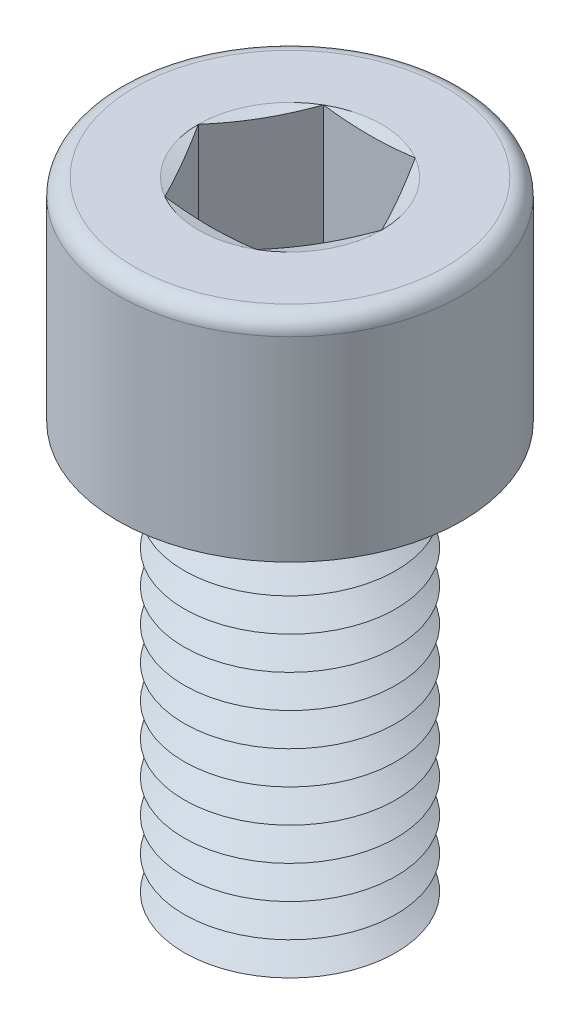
ISO-10303-21;
HEADER;
FILE_DESCRIPTION(('STEP AP214'),'2;1');
FILE_NAME('part.step','',(''),(''),'','','');
FILE_SCHEMA(('AUTOMOTIVE_DESIGN { 1 0 10303 214 1 1 1 1 }'));
ENDSEC;
DATA;
#1=APPLICATION_CONTEXT('core data for automotive mechanical design processes');
#2=APPLICATION_PROTOCOL_DEFINITION('international standard','automotive_design',2000,#1);
#3=PRODUCT_CONTEXT('',#1,'mechanical');
#4=PRODUCT('Part','Part','',(#3));
#5=PRODUCT_RELATED_PRODUCT_CATEGORY('part','',(#4));
#6=PRODUCT_DEFINITION_FORMATION('','',#4);
#7=PRODUCT_DEFINITION_CONTEXT('part definition',#1,'design');
#8=PRODUCT_DEFINITION('design','',#6,#7);
#9=PRODUCT_DEFINITION_SHAPE('','',#8);
#10=(LENGTH_UNIT() NAMED_UNIT(*) SI_UNIT(.MILLI.,.METRE.));
#11=(NAMED_UNIT(*) PLANE_ANGLE_UNIT() SI_UNIT($,.RADIAN.));
#12=(NAMED_UNIT(*) SI_UNIT($,.STERADIAN.) SOLID_ANGLE_UNIT());
#13=UNCERTAINTY_MEASURE_WITH_UNIT(LENGTH_MEASURE(1.E-05),#10,'distance_accuracy_value','');
#14=(GEOMETRIC_REPRESENTATION_CONTEXT(3) GLOBAL_UNCERTAINTY_ASSIGNED_CONTEXT((#13)) GLOBAL_UNIT_ASSIGNED_CONTEXT((#10,
#11,#12)) REPRESENTATION_CONTEXT('',''));
#15=CARTESIAN_POINT('',(0.,0.,0.));
#16=DIRECTION('',(0.,0.,1.));
#17=DIRECTION('',(1.,0.,0.));
#18=AXIS2_PLACEMENT_3D('',#15,#16,#17);
#19=CARTESIAN_POINT('',(0.,5.,0.));
#20=DIRECTION('',(0.,1.,0.));
#21=DIRECTION('',(0.,0.,1.));
#22=AXIS2_PLACEMENT_3D('',#19,#20,#21);
#23=CONICAL_SURFACE('',#22,2.91746824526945,1.0471975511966);
#24=CARTESIAN_POINT('',(0.,5.625,0.));
#25=DIRECTION('',(0.,1.,0.));
#26=DIRECTION('',(0.,0.,1.));
#27=AXIS2_PLACEMENT_3D('',#24,#25,#26);
#28=CIRCLE('',#27,4.);
#29=CARTESIAN_POINT('',(0.,5.625,4.));
#30=VERTEX_POINT('',#29);
#31=EDGE_CURVE('E414',#30,#30,#28,.T.);
#32=ORIENTED_EDGE('',*,*,#31,.F.);
#33=EDGE_LOOP('',(#32));
#34=FACE_BOUND('',#33,.T.);
#35=CARTESIAN_POINT('',(0.,5.,0.));
#36=DIRECTION('',(0.,1.,0.));
#37=DIRECTION('',(0.,0.,1.));
#38=AXIS2_PLACEMENT_3D('',#35,#36,#37);
#39=CIRCLE('',#38,2.91746824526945);
#40=CARTESIAN_POINT('',(0.,5.,2.91746824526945));
#41=VERTEX_POINT('',#40);
#42=EDGE_CURVE('E418',#41,#41,#39,.T.);
#43=ORIENTED_EDGE('',*,*,#42,.T.);
#44=EDGE_LOOP('',(#43));
#45=FACE_BOUND('',#44,.T.);
#46=ADVANCED_FACE('F41',(#34,#45),#23,.T.);
#47=CARTESIAN_POINT('',(0.,4.375,0.));
#48=DIRECTION('',(0.,-1.,0.));
#49=DIRECTION('',(0.,0.,-1.));
#50=AXIS2_PLACEMENT_3D('',#47,#48,#49);
#51=CONICAL_SURFACE('',#50,4.,1.0471975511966);
#52=ORIENTED_EDGE('',*,*,#42,.F.);
#53=EDGE_LOOP('',(#52));
#54=FACE_BOUND('',#53,.T.);
#55=CARTESIAN_POINT('',(0.,4.375,0.));
#56=DIRECTION('',(0.,1.,0.));
#57=DIRECTION('',(0.,0.,1.));
#58=AXIS2_PLACEMENT_3D('',#55,#56,#57);
#59=CIRCLE('',#58,4.);
#60=CARTESIAN_POINT('',(0.,4.375,4.));
#61=VERTEX_POINT('',#60);
#62=EDGE_CURVE('E422',#61,#61,#59,.T.);
#63=ORIENTED_EDGE('',*,*,#62,.T.);
#64=EDGE_LOOP('',(#63));
#65=FACE_BOUND('',#64,.T.);
#66=ADVANCED_FACE('F251',(#54,#65),#51,.T.);
#67=CARTESIAN_POINT('',(0.,0.,0.));
#68=DIRECTION('',(0.,1.,0.));
#69=DIRECTION('',(0.,0.,1.));
#70=AXIS2_PLACEMENT_3D('',#67,#68,#69);
#71=PLANE('',#70);
#72=CARTESIAN_POINT('',(0.,0.,0.));
#73=DIRECTION('',(0.,1.,0.));
#74=DIRECTION('',(0.,0.,1.));
#75=AXIS2_PLACEMENT_3D('',#72,#73,#74);
#76=CIRCLE('',#75,2.91746824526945);
#77=CARTESIAN_POINT('',(0.,0.,2.91746824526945));
#78=VERTEX_POINT('',#77);
#79=EDGE_CURVE('E450',#78,#78,#76,.T.);
#80=ORIENTED_EDGE('',*,*,#79,.F.);
#81=EDGE_LOOP('',(#80));
#82=FACE_BOUND('',#81,.T.);
#83=ADVANCED_FACE('F248',(#82),#71,.F.);
#84=CARTESIAN_POINT('',(0.,0.,0.));
#85=DIRECTION('',(0.,1.,0.));
#86=DIRECTION('',(0.,0.,1.));
#87=AXIS2_PLACEMENT_3D('',#84,#85,#86);
#88=CONICAL_SURFACE('',#87,2.91746824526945,1.0471975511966);
#89=CARTESIAN_POINT('',(0.,0.624999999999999,0.));
#90=DIRECTION('',(0.,1.,0.));
#91=DIRECTION('',(0.,0.,1.));
#92=AXIS2_PLACEMENT_3D('',#89,#90,#91);
#93=CIRCLE('',#92,4.);
#94=CARTESIAN_POINT('',(0.,0.624999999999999,4.));
#95=VERTEX_POINT('',#94);
#96=EDGE_CURVE('E446',#95,#95,#93,.T.);
#97=ORIENTED_EDGE('',*,*,#96,.F.);
#98=EDGE_LOOP('',(#97));
#99=FACE_BOUND('',#98,.T.);
#100=ORIENTED_EDGE('',*,*,#79,.T.);
#101=EDGE_LOOP('',(#100));
#102=FACE_BOUND('',#101,.T.);
#103=ADVANCED_FACE('F250',(#99,#102),#88,.T.);
#104=CARTESIAN_POINT('',(0.,0.624999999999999,0.));
#105=DIRECTION('',(0.,-1.,0.));
#106=DIRECTION('',(0.,0.,-1.));
#107=AXIS2_PLACEMENT_3D('',#104,#105,#106);
#108=CONICAL_SURFACE('',#107,4.,1.0471975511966);
#109=CARTESIAN_POINT('',(0.,1.25,0.));
#110=DIRECTION('',(0.,1.,0.));
#111=DIRECTION('',(0.,0.,1.));
#112=AXIS2_PLACEMENT_3D('',#109,#110,#111);
#113=CIRCLE('',#112,2.91746824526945);
#114=CARTESIAN_POINT('',(0.,1.25,2.91746824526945));
#115=VERTEX_POINT('',#114);
#116=EDGE_CURVE('E442',#115,#115,#113,.T.);
#117=ORIENTED_EDGE('',*,*,#116,.F.);
#118=EDGE_LOOP('',(#117));
#119=FACE_BOUND('',#118,.T.);
#120=ORIENTED_EDGE('',*,*,#96,.T.);
#121=EDGE_LOOP('',(#120));
#122=FACE_BOUND('',#121,.T.);
#123=ADVANCED_FACE('F291',(#119,#122),#108,.T.);
#124=CARTESIAN_POINT('',(0.,1.25,0.));
#125=DIRECTION('',(0.,1.,0.));
#126=DIRECTION('',(0.,0.,1.));
#127=AXIS2_PLACEMENT_3D('',#124,#125,#126);
#128=CONICAL_SURFACE('',#127,2.91746824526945,1.0471975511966);
#129=CARTESIAN_POINT('',(0.,1.875,0.));
#130=DIRECTION('',(0.,1.,0.));
#131=DIRECTION('',(0.,0.,1.));
#132=AXIS2_PLACEMENT_3D('',#129,#130,#131);
#133=CIRCLE('',#132,4.);
#134=CARTESIAN_POINT('',(0.,1.875,4.));
#135=VERTEX_POINT('',#134);
#136=EDGE_CURVE('E438',#135,#135,#133,.T.);
#137=ORIENTED_EDGE('',*,*,#136,.F.);
#138=EDGE_LOOP('',(#137));
#139=FACE_BOUND('',#138,.T.);
#140=ORIENTED_EDGE('',*,*,#116,.T.);
#141=EDGE_LOOP('',(#140));
#142=FACE_BOUND('',#141,.T.);
#143=ADVANCED_FACE('F286',(#139,#142),#128,.T.);
#144=CARTESIAN_POINT('',(0.,1.875,0.));
#145=DIRECTION('',(0.,-1.,0.));
#146=DIRECTION('',(0.,0.,-1.));
#147=AXIS2_PLACEMENT_3D('',#144,#145,#146);
#148=CONICAL_SURFACE('',#147,4.,1.0471975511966);
#149=CARTESIAN_POINT('',(0.,2.5,0.));
#150=DIRECTION('',(0.,1.,0.));
#151=DIRECTION('',(0.,0.,1.));
#152=AXIS2_PLACEMENT_3D('',#149,#150,#151);
#153=CIRCLE('',#152,2.91746824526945);
#154=CARTESIAN_POINT('',(0.,2.5,2.91746824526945));
#155=VERTEX_POINT('',#154);
#156=EDGE_CURVE('E434',#155,#155,#153,.T.);
#157=ORIENTED_EDGE('',*,*,#156,.F.);
#158=EDGE_LOOP('',(#157));
#159=FACE_BOUND('',#158,.T.);
#160=ORIENTED_EDGE('',*,*,#136,.T.);
#161=EDGE_LOOP('',(#160));
#162=FACE_BOUND('',#161,.T.);
#163=ADVANCED_FACE('F283',(#159,#162),#148,.T.);
#164=CARTESIAN_POINT('',(0.,2.5,0.));
#165=DIRECTION('',(0.,1.,0.));
#166=DIRECTION('',(0.,0.,1.));
#167=AXIS2_PLACEMENT_3D('',#164,#165,#166);
#168=CONICAL_SURFACE('',#167,2.91746824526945,1.0471975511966);
#169=CARTESIAN_POINT('',(0.,3.125,0.));
#170=DIRECTION('',(0.,1.,0.));
#171=DIRECTION('',(0.,0.,1.));
#172=AXIS2_PLACEMENT_3D('',#169,#170,#171);
#173=CIRCLE('',#172,4.);
#174=CARTESIAN_POINT('',(0.,3.125,4.));
#175=VERTEX_POINT('',#174);
#176=EDGE_CURVE('E430',#175,#175,#173,.T.);
#177=ORIENTED_EDGE('',*,*,#176,.F.);
#178=EDGE_LOOP('',(#177));
#179=FACE_BOUND('',#178,.T.);
#180=ORIENTED_EDGE('',*,*,#156,.T.);
#181=EDGE_LOOP('',(#180));
#182=FACE_BOUND('',#181,.T.);
#183=ADVANCED_FACE('F277',(#179,#182),#168,.T.);
#184=CARTESIAN_POINT('',(0.,3.125,0.));
#185=DIRECTION('',(0.,-1.,0.));
#186=DIRECTION('',(0.,0.,-1.));
#187=AXIS2_PLACEMENT_3D('',#184,#185,#186);
#188=CONICAL_SURFACE('',#187,4.,1.0471975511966);
#189=CARTESIAN_POINT('',(0.,3.75,0.));
#190=DIRECTION('',(0.,1.,0.));
#191=DIRECTION('',(0.,0.,1.));
#192=AXIS2_PLACEMENT_3D('',#189,#190,#191);
#193=CIRCLE('',#192,2.91746824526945);
#194=CARTESIAN_POINT('',(0.,3.75,2.91746824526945));
#195=VERTEX_POINT('',#194);
#196=EDGE_CURVE('E426',#195,#195,#193,.T.);
#197=ORIENTED_EDGE('',*,*,#196,.F.);
#198=EDGE_LOOP('',(#197));
#199=FACE_BOUND('',#198,.T.);
#200=ORIENTED_EDGE('',*,*,#176,.T.);
#201=EDGE_LOOP('',(#200));
#202=FACE_BOUND('',#201,.T.);
#203=ADVANCED_FACE('F273',(#199,#202),#188,.T.);
#204=CARTESIAN_POINT('',(0.,3.75,0.));
#205=DIRECTION('',(0.,1.,0.));
#206=DIRECTION('',(0.,0.,1.));
#207=AXIS2_PLACEMENT_3D('',#204,#205,#206);
#208=CONICAL_SURFACE('',#207,2.91746824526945,1.0471975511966);
#209=ORIENTED_EDGE('',*,*,#62,.F.);
#210=EDGE_LOOP('',(#209));
#211=FACE_BOUND('',#210,.T.);
#212=ORIENTED_EDGE('',*,*,#196,.T.);
#213=EDGE_LOOP('',(#212));
#214=FACE_BOUND('',#213,.T.);
#215=ADVANCED_FACE('F276',(#211,#214),#208,.T.);
#216=CARTESIAN_POINT('',(0.,6.25,0.));
#217=DIRECTION('',(0.,1.,0.));
#218=DIRECTION('',(0.,0.,1.));
#219=AXIS2_PLACEMENT_3D('',#216,#217,#218);
#220=CONICAL_SURFACE('',#219,2.91746824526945,1.0471975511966);
#221=CARTESIAN_POINT('',(0.,6.875,0.));
#222=DIRECTION('',(0.,1.,0.));
#223=DIRECTION('',(0.,0.,1.));
#224=AXIS2_PLACEMENT_3D('',#221,#222,#223);
#225=CIRCLE('',#224,4.);
#226=CARTESIAN_POINT('',(0.,6.875,4.));
#227=VERTEX_POINT('',#226);
#228=EDGE_CURVE('E406',#227,#227,#225,.T.);
#229=ORIENTED_EDGE('',*,*,#228,.F.);
#230=EDGE_LOOP('',(#229));
#231=FACE_BOUND('',#230,.T.);
#232=CARTESIAN_POINT('',(0.,6.25,0.));
#233=DIRECTION('',(0.,1.,0.));
#234=DIRECTION('',(0.,0.,1.));
#235=AXIS2_PLACEMENT_3D('',#232,#233,#234);
#236=CIRCLE('',#235,2.91746824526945);
#237=CARTESIAN_POINT('',(0.,6.25,2.91746824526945));
#238=VERTEX_POINT('',#237);
#239=EDGE_CURVE('E410',#238,#238,#236,.T.);
#240=ORIENTED_EDGE('',*,*,#239,.T.);
#241=EDGE_LOOP('',(#240));
#242=FACE_BOUND('',#241,.T.);
#243=ADVANCED_FACE('F281',(#231,#242),#220,.T.);
#244=CARTESIAN_POINT('',(0.,5.625,0.));
#245=DIRECTION('',(0.,-1.,0.));
#246=DIRECTION('',(0.,0.,-1.));
#247=AXIS2_PLACEMENT_3D('',#244,#245,#246);
#248=CONICAL_SURFACE('',#247,4.,1.0471975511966);
#249=ORIENTED_EDGE('',*,*,#239,.F.);
#250=EDGE_LOOP('',(#249));
#251=FACE_BOUND('',#250,.T.);
#252=ORIENTED_EDGE('',*,*,#31,.T.);
#253=EDGE_LOOP('',(#252));
#254=FACE_BOUND('',#253,.T.);
#255=ADVANCED_FACE('F691',(#251,#254),#248,.T.);
#256=CARTESIAN_POINT('',(0.,7.5,0.));
#257=DIRECTION('',(0.,1.,0.));
#258=DIRECTION('',(0.,0.,1.));
#259=AXIS2_PLACEMENT_3D('',#256,#257,#258);
#260=CONICAL_SURFACE('',#259,2.91746824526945,1.0471975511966);
#261=CARTESIAN_POINT('',(0.,8.125,0.));
#262=DIRECTION('',(0.,1.,0.));
#263=DIRECTION('',(0.,0.,1.));
#264=AXIS2_PLACEMENT_3D('',#261,#262,#263);
#265=CIRCLE('',#264,4.);
#266=CARTESIAN_POINT('',(0.,8.125,4.));
#267=VERTEX_POINT('',#266);
#268=EDGE_CURVE('E398',#267,#267,#265,.T.);
#269=ORIENTED_EDGE('',*,*,#268,.F.);
#270=EDGE_LOOP('',(#269));
#271=FACE_BOUND('',#270,.T.);
#272=CARTESIAN_POINT('',(0.,7.5,0.));
#273=DIRECTION('',(0.,1.,0.));
#274=DIRECTION('',(0.,0.,1.));
#275=AXIS2_PLACEMENT_3D('',#272,#273,#274);
#276=CIRCLE('',#275,2.91746824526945);
#277=CARTESIAN_POINT('',(0.,7.5,2.91746824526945));
#278=VERTEX_POINT('',#277);
#279=EDGE_CURVE('E402',#278,#278,#276,.T.);
#280=ORIENTED_EDGE('',*,*,#279,.T.);
#281=EDGE_LOOP('',(#280));
#282=FACE_BOUND('',#281,.T.);
#283=ADVANCED_FACE('F700',(#271,#282),#260,.T.);
#284=CARTESIAN_POINT('',(0.,6.875,0.));
#285=DIRECTION('',(0.,-1.,0.));
#286=DIRECTION('',(0.,0.,-1.));
#287=AXIS2_PLACEMENT_3D('',#284,#285,#286);
#288=CONICAL_SURFACE('',#287,4.,1.0471975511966);
#289=ORIENTED_EDGE('',*,*,#279,.F.);
#290=EDGE_LOOP('',(#289));
#291=FACE_BOUND('',#290,.T.);
#292=ORIENTED_EDGE('',*,*,#228,.T.);
#293=EDGE_LOOP('',(#292));
#294=FACE_BOUND('',#293,.T.);
#295=ADVANCED_FACE('F710',(#291,#294),#288,.T.);
#296=CARTESIAN_POINT('',(0.,8.75,0.));
#297=DIRECTION('',(0.,1.,0.));
#298=DIRECTION('',(0.,0.,1.));
#299=AXIS2_PLACEMENT_3D('',#296,#297,#298);
#300=CONICAL_SURFACE('',#299,2.91746824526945,1.0471975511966);
#301=CARTESIAN_POINT('',(0.,9.375,0.));
#302=DIRECTION('',(0.,1.,0.));
#303=DIRECTION('',(0.,0.,1.));
#304=AXIS2_PLACEMENT_3D('',#301,#302,#303);
#305=CIRCLE('',#304,4.);
#306=CARTESIAN_POINT('',(0.,9.375,4.));
#307=VERTEX_POINT('',#306);
#308=EDGE_CURVE('E391',#307,#307,#305,.T.);
#309=ORIENTED_EDGE('',*,*,#308,.F.);
#310=EDGE_LOOP('',(#309));
#311=FACE_BOUND('',#310,.T.);
#312=CARTESIAN_POINT('',(0.,8.75,0.));
#313=DIRECTION('',(0.,1.,0.));
#314=DIRECTION('',(0.,0.,1.));
#315=AXIS2_PLACEMENT_3D('',#312,#313,#314);
#316=CIRCLE('',#315,2.91746824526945);
#317=CARTESIAN_POINT('',(0.,8.75,2.91746824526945));
#318=VERTEX_POINT('',#317);
#319=EDGE_CURVE('E395',#318,#318,#316,.T.);
#320=ORIENTED_EDGE('',*,*,#319,.T.);
#321=EDGE_LOOP('',(#320));
#322=FACE_BOUND('',#321,.T.);
#323=ADVANCED_FACE('F720',(#311,#322),#300,.T.);
#324=CARTESIAN_POINT('',(0.,8.125,0.));
#325=DIRECTION('',(0.,-1.,0.));
#326=DIRECTION('',(0.,0.,-1.));
#327=AXIS2_PLACEMENT_3D('',#324,#325,#326);
#328=CONICAL_SURFACE('',#327,4.,1.0471975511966);
#329=ORIENTED_EDGE('',*,*,#319,.F.);
#330=EDGE_LOOP('',(#329));
#331=FACE_BOUND('',#330,.T.);
#332=ORIENTED_EDGE('',*,*,#268,.T.);
#333=EDGE_LOOP('',(#332));
#334=FACE_BOUND('',#333,.T.);
#335=ADVANCED_FACE('F730',(#331,#334),#328,.T.);
#336=CARTESIAN_POINT('',(0.,10.,0.));
#337=DIRECTION('',(0.,1.,0.));
#338=DIRECTION('',(0.,0.,1.));
#339=AXIS2_PLACEMENT_3D('',#336,#337,#338);
#340=CONICAL_SURFACE('',#339,2.91746824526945,1.0471975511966);
#341=CARTESIAN_POINT('',(0.,10.625,0.));
#342=DIRECTION('',(0.,1.,0.));
#343=DIRECTION('',(0.,0.,1.));
#344=AXIS2_PLACEMENT_3D('',#341,#342,#343);
#345=CIRCLE('',#344,4.);
#346=CARTESIAN_POINT('',(0.,10.625,4.));
#347=VERTEX_POINT('',#346);
#348=EDGE_CURVE('E383',#347,#347,#345,.T.);
#349=ORIENTED_EDGE('',*,*,#348,.F.);
#350=EDGE_LOOP('',(#349));
#351=FACE_BOUND('',#350,.T.);
#352=CARTESIAN_POINT('',(0.,10.,0.));
#353=DIRECTION('',(0.,1.,0.));
#354=DIRECTION('',(0.,0.,1.));
#355=AXIS2_PLACEMENT_3D('',#352,#353,#354);
#356=CIRCLE('',#355,2.91746824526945);
#357=CARTESIAN_POINT('',(0.,10.,2.91746824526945));
#358=VERTEX_POINT('',#357);
#359=EDGE_CURVE('E387',#358,#358,#356,.T.);
#360=ORIENTED_EDGE('',*,*,#359,.T.);
#361=EDGE_LOOP('',(#360));
#362=FACE_BOUND('',#361,.T.);
#363=ADVANCED_FACE('F740',(#351,#362),#340,.T.);
#364=CARTESIAN_POINT('',(0.,9.375,0.));
#365=DIRECTION('',(0.,-1.,0.));
#366=DIRECTION('',(0.,0.,-1.));
#367=AXIS2_PLACEMENT_3D('',#364,#365,#366);
#368=CONICAL_SURFACE('',#367,4.,1.0471975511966);
#369=ORIENTED_EDGE('',*,*,#359,.F.);
#370=EDGE_LOOP('',(#369));
#371=FACE_BOUND('',#370,.T.);
#372=ORIENTED_EDGE('',*,*,#308,.T.);
#373=EDGE_LOOP('',(#372));
#374=FACE_BOUND('',#373,.T.);
#375=ADVANCED_FACE('F750',(#371,#374),#368,.T.);
#376=CARTESIAN_POINT('',(0.,11.25,0.));
#377=DIRECTION('',(0.,1.,0.));
#378=DIRECTION('',(0.,0.,1.));
#379=AXIS2_PLACEMENT_3D('',#376,#377,#378);
#380=CONICAL_SURFACE('',#379,2.91746824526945,1.0471975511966);
#381=CARTESIAN_POINT('',(0.,11.875,0.));
#382=DIRECTION('',(0.,1.,0.));
#383=DIRECTION('',(0.,0.,1.));
#384=AXIS2_PLACEMENT_3D('',#381,#382,#383);
#385=CIRCLE('',#384,4.);
#386=CARTESIAN_POINT('',(0.,11.875,4.));
#387=VERTEX_POINT('',#386);
#388=EDGE_CURVE('E376',#387,#387,#385,.T.);
#389=ORIENTED_EDGE('',*,*,#388,.F.);
#390=EDGE_LOOP('',(#389));
#391=FACE_BOUND('',#390,.T.);
#392=CARTESIAN_POINT('',(0.,11.25,0.));
#393=DIRECTION('',(0.,1.,0.));
#394=DIRECTION('',(0.,0.,1.));
#395=AXIS2_PLACEMENT_3D('',#392,#393,#394);
#396=CIRCLE('',#395,2.91746824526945);
#397=CARTESIAN_POINT('',(0.,11.25,2.91746824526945));
#398=VERTEX_POINT('',#397);
#399=EDGE_CURVE('E380',#398,#398,#396,.T.);
#400=ORIENTED_EDGE('',*,*,#399,.T.);
#401=EDGE_LOOP('',(#400));
#402=FACE_BOUND('',#401,.T.);
#403=ADVANCED_FACE('F760',(#391,#402),#380,.T.);
#404=CARTESIAN_POINT('',(0.,10.625,0.));
#405=DIRECTION('',(0.,-1.,0.));
#406=DIRECTION('',(0.,0.,-1.));
#407=AXIS2_PLACEMENT_3D('',#404,#405,#406);
#408=CONICAL_SURFACE('',#407,4.,1.0471975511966);
#409=ORIENTED_EDGE('',*,*,#399,.F.);
#410=EDGE_LOOP('',(#409));
#411=FACE_BOUND('',#410,.T.);
#412=ORIENTED_EDGE('',*,*,#348,.T.);
#413=EDGE_LOOP('',(#412));
#414=FACE_BOUND('',#413,.T.);
#415=ADVANCED_FACE('F770',(#411,#414),#408,.T.);
#416=CARTESIAN_POINT('',(0.,12.5,0.));
#417=DIRECTION('',(0.,1.,0.));
#418=DIRECTION('',(0.,0.,1.));
#419=AXIS2_PLACEMENT_3D('',#416,#417,#418);
#420=CONICAL_SURFACE('',#419,2.91746824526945,1.0471975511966);
#421=CARTESIAN_POINT('',(0.,13.125,0.));
#422=DIRECTION('',(0.,1.,0.));
#423=DIRECTION('',(0.,0.,1.));
#424=AXIS2_PLACEMENT_3D('',#421,#422,#423);
#425=CIRCLE('',#424,4.);
#426=CARTESIAN_POINT('',(0.,13.125,4.));
#427=VERTEX_POINT('',#426);
#428=EDGE_CURVE('E368',#427,#427,#425,.T.);
#429=ORIENTED_EDGE('',*,*,#428,.F.);
#430=EDGE_LOOP('',(#429));
#431=FACE_BOUND('',#430,.T.);
#432=CARTESIAN_POINT('',(0.,12.5,0.));
#433=DIRECTION('',(0.,1.,0.));
#434=DIRECTION('',(0.,0.,1.));
#435=AXIS2_PLACEMENT_3D('',#432,#433,#434);
#436=CIRCLE('',#435,2.91746824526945);
#437=CARTESIAN_POINT('',(0.,12.5,2.91746824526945));
#438=VERTEX_POINT('',#437);
#439=EDGE_CURVE('E372',#438,#438,#436,.T.);
#440=ORIENTED_EDGE('',*,*,#439,.T.);
#441=EDGE_LOOP('',(#440));
#442=FACE_BOUND('',#441,.T.);
#443=ADVANCED_FACE('F780',(#431,#442),#420,.T.);
#444=CARTESIAN_POINT('',(0.,11.875,0.));
#445=DIRECTION('',(0.,-1.,0.));
#446=DIRECTION('',(0.,0.,-1.));
#447=AXIS2_PLACEMENT_3D('',#444,#445,#446);
#448=CONICAL_SURFACE('',#447,4.,1.0471975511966);
#449=ORIENTED_EDGE('',*,*,#439,.F.);
#450=EDGE_LOOP('',(#449));
#451=FACE_BOUND('',#450,.T.);
#452=ORIENTED_EDGE('',*,*,#388,.T.);
#453=EDGE_LOOP('',(#452));
#454=FACE_BOUND('',#453,.T.);
#455=ADVANCED_FACE('F790',(#451,#454),#448,.T.);
#456=CARTESIAN_POINT('',(0.,13.75,0.));
#457=DIRECTION('',(0.,1.,0.));
#458=DIRECTION('',(0.,0.,1.));
#459=AXIS2_PLACEMENT_3D('',#456,#457,#458);
#460=CONICAL_SURFACE('',#459,2.91746824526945,1.0471975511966);
#461=CARTESIAN_POINT('',(0.,14.375,0.));
#462=DIRECTION('',(0.,1.,0.));
#463=DIRECTION('',(0.,0.,1.));
#464=AXIS2_PLACEMENT_3D('',#461,#462,#463);
#465=CIRCLE('',#464,4.);
#466=CARTESIAN_POINT('',(0.,14.375,4.));
#467=VERTEX_POINT('',#466);
#468=EDGE_CURVE('E353',#467,#467,#465,.T.);
#469=ORIENTED_EDGE('',*,*,#468,.F.);
#470=EDGE_LOOP('',(#469));
#471=FACE_BOUND('',#470,.T.);
#472=CARTESIAN_POINT('',(0.,13.75,0.));
#473=DIRECTION('',(0.,1.,0.));
#474=DIRECTION('',(0.,0.,1.));
#475=AXIS2_PLACEMENT_3D('',#472,#473,#474);
#476=CIRCLE('',#475,2.91746824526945);
#477=CARTESIAN_POINT('',(0.,13.75,2.91746824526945));
#478=VERTEX_POINT('',#477);
#479=EDGE_CURVE('E364',#478,#478,#476,.T.);
#480=ORIENTED_EDGE('',*,*,#479,.T.);
#481=EDGE_LOOP('',(#480));
#482=FACE_BOUND('',#481,.T.);
#483=ADVANCED_FACE('F800',(#471,#482),#460,.T.);
#484=CARTESIAN_POINT('',(0.,13.125,0.));
#485=DIRECTION('',(0.,-1.,0.));
#486=DIRECTION('',(0.,0.,-1.));
#487=AXIS2_PLACEMENT_3D('',#484,#485,#486);
#488=CONICAL_SURFACE('',#487,4.,1.0471975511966);
#489=ORIENTED_EDGE('',*,*,#479,.F.);
#490=EDGE_LOOP('',(#489));
#491=FACE_BOUND('',#490,.T.);
#492=ORIENTED_EDGE('',*,*,#428,.T.);
#493=EDGE_LOOP('',(#492));
#494=FACE_BOUND('',#493,.T.);
#495=ADVANCED_FACE('F810',(#491,#494),#488,.T.);
#496=CARTESIAN_POINT('',(0.,15.,0.));
#497=DIRECTION('',(0.,1.,0.));
#498=DIRECTION('',(0.,0.,1.));
#499=AXIS2_PLACEMENT_3D('',#496,#497,#498);
#500=CONICAL_SURFACE('',#499,2.91746824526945,1.0471975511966);
#501=CARTESIAN_POINT('',(0.,15.625,0.));
#502=DIRECTION('',(0.,1.,0.));
#503=DIRECTION('',(0.,0.,1.));
#504=AXIS2_PLACEMENT_3D('',#501,#502,#503);
#505=CIRCLE('',#504,4.);
#506=CARTESIAN_POINT('',(0.,15.625,4.));
#507=VERTEX_POINT('',#506);
#508=EDGE_CURVE('E360',#507,#507,#505,.T.);
#509=ORIENTED_EDGE('',*,*,#508,.F.);
#510=EDGE_LOOP('',(#509));
#511=FACE_BOUND('',#510,.T.);
#512=CARTESIAN_POINT('',(0.,15.,0.));
#513=DIRECTION('',(0.,1.,0.));
#514=DIRECTION('',(0.,0.,1.));
#515=AXIS2_PLACEMENT_3D('',#512,#513,#514);
#516=CIRCLE('',#515,2.91746824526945);
#517=CARTESIAN_POINT('',(0.,15.,2.91746824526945));
#518=VERTEX_POINT('',#517);
#519=EDGE_CURVE('E348',#518,#518,#516,.T.);
#520=ORIENTED_EDGE('',*,*,#519,.T.);
#521=EDGE_LOOP('',(#520));
#522=FACE_BOUND('',#521,.T.);
#523=ADVANCED_FACE('F820',(#511,#522),#500,.T.);
#524=CARTESIAN_POINT('',(0.,14.375,0.));
#525=DIRECTION('',(0.,-1.,0.));
#526=DIRECTION('',(0.,0.,-1.));
#527=AXIS2_PLACEMENT_3D('',#524,#525,#526);
#528=CONICAL_SURFACE('',#527,4.,1.0471975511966);
#529=ORIENTED_EDGE('',*,*,#519,.F.);
#530=EDGE_LOOP('',(#529));
#531=FACE_BOUND('',#530,.T.);
#532=ORIENTED_EDGE('',*,*,#468,.T.);
#533=EDGE_LOOP('',(#532));
#534=FACE_BOUND('',#533,.T.);
#535=ADVANCED_FACE('F195',(#531,#534),#528,.T.);
#536=CARTESIAN_POINT('',(0.,24.,0.));
#537=DIRECTION('',(0.,1.,0.));
#538=DIRECTION('',(0.,0.,1.));
#539=AXIS2_PLACEMENT_3D('',#536,#537,#538);
#540=PLANE('',#539);
#541=CARTESIAN_POINT('',(0.,24.,0.));
#542=DIRECTION('',(0.,1.,0.));
#543=DIRECTION('',(0.,0.,1.));
#544=AXIS2_PLACEMENT_3D('',#541,#542,#543);
#545=CIRCLE('',#544,3.46410161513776);
#546=CARTESIAN_POINT('',(1.73205080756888,24.,3.));
#547=VERTEX_POINT('',#546);
#548=CARTESIAN_POINT('',(3.46410161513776,24.,0.));
#549=VERTEX_POINT('',#548);
#550=EDGE_CURVE('E121',#547,#549,#545,.T.);
#551=ORIENTED_EDGE('',*,*,#550,.F.);
#552=CARTESIAN_POINT('',(0.,24.,0.));
#553=DIRECTION('',(0.,1.,0.));
#554=DIRECTION('',(0.,0.,1.));
#555=AXIS2_PLACEMENT_3D('',#552,#553,#554);
#556=CIRCLE('',#555,3.46410161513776);
#557=CARTESIAN_POINT('',(-1.73205080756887,24.,3.));
#558=VERTEX_POINT('',#557);
#559=EDGE_CURVE('E45',#558,#547,#556,.T.);
#560=ORIENTED_EDGE('',*,*,#559,.F.);
#561=CARTESIAN_POINT('',(-3.46410161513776,24.,0.));
#562=VERTEX_POINT('',#561);
#563=EDGE_CURVE('E138',#562,#558,#556,.T.);
#564=ORIENTED_EDGE('',*,*,#563,.F.);
#565=CARTESIAN_POINT('',(-1.73205080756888,24.,-3.));
#566=VERTEX_POINT('',#565);
#567=EDGE_CURVE('E522',#566,#562,#556,.T.);
#568=ORIENTED_EDGE('',*,*,#567,.F.);
#569=CARTESIAN_POINT('',(1.73205080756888,24.,-3.));
#570=VERTEX_POINT('',#569);
#571=EDGE_CURVE('E51',#570,#566,#556,.T.);
#572=ORIENTED_EDGE('',*,*,#571,.F.);
#573=EDGE_CURVE('E11',#549,#570,#556,.T.);
#574=ORIENTED_EDGE('',*,*,#573,.F.);
#575=EDGE_LOOP('',(#551,#560,#564,#568,#572,#574));
#576=FACE_BOUND('',#575,.T.);
#577=CARTESIAN_POINT('',(0.,24.,0.));
#578=DIRECTION('',(0.,1.,0.));
#579=DIRECTION('',(0.,0.,1.));
#580=AXIS2_PLACEMENT_3D('',#577,#578,#579);
#581=CIRCLE('',#580,5.875);
#582=CARTESIAN_POINT('',(0.,24.,5.875));
#583=VERTEX_POINT('',#582);
#584=EDGE_CURVE('E495',#583,#583,#581,.T.);
#585=ORIENTED_EDGE('',*,*,#584,.T.);
#586=EDGE_LOOP('',(#585));
#587=FACE_BOUND('',#586,.T.);
#588=ADVANCED_FACE('F140',(#576,#587),#540,.T.);
#589=CARTESIAN_POINT('',(0.,23.375,0.));
#590=DIRECTION('',(0.,1.,0.));
#591=DIRECTION('',(0.,0.,1.));
#592=AXIS2_PLACEMENT_3D('',#589,#590,#591);
#593=TOROIDAL_SURFACE('',#592,5.875,0.625);
#594=CARTESIAN_POINT('',(0.,23.375,0.));
#595=DIRECTION('',(0.,1.,0.));
#596=DIRECTION('',(0.,0.,1.));
#597=AXIS2_PLACEMENT_3D('',#594,#595,#596);
#598=CIRCLE('',#597,6.5);
#599=CARTESIAN_POINT('',(0.,23.375,6.5));
#600=VERTEX_POINT('',#599);
#601=EDGE_CURVE('E499',#600,#600,#598,.F.);
#602=ORIENTED_EDGE('',*,*,#601,.F.);
#603=EDGE_LOOP('',(#602));
#604=FACE_BOUND('',#603,.T.);
#605=ORIENTED_EDGE('',*,*,#584,.F.);
#606=EDGE_LOOP('',(#605));
#607=FACE_BOUND('',#606,.T.);
#608=ADVANCED_FACE('F43',(#604,#607),#593,.T.);
#609=CARTESIAN_POINT('',(0.,24.,0.));
#610=DIRECTION('',(0.,-1.,0.));
#611=DIRECTION('',(0.,0.,-1.));
#612=AXIS2_PLACEMENT_3D('',#609,#610,#611);
#613=CYLINDRICAL_SURFACE('',#612,6.5);
#614=ORIENTED_EDGE('',*,*,#601,.T.);
#615=EDGE_LOOP('',(#614));
#616=FACE_BOUND('',#615,.T.);
#617=CARTESIAN_POINT('',(0.,16.,0.));
#618=DIRECTION('',(0.,1.,0.));
#619=DIRECTION('',(0.,0.,1.));
#620=AXIS2_PLACEMENT_3D('',#617,#618,#619);
#621=CIRCLE('',#620,6.5);
#622=CARTESIAN_POINT('',(0.,16.,6.5));
#623=VERTEX_POINT('',#622);
#624=EDGE_CURVE('E482',#623,#623,#621,.T.);
#625=ORIENTED_EDGE('',*,*,#624,.T.);
#626=EDGE_LOOP('',(#625));
#627=FACE_BOUND('',#626,.T.);
#628=ADVANCED_FACE('F243',(#616,#627),#613,.T.);
#629=CARTESIAN_POINT('',(0.,16.,0.));
#630=DIRECTION('',(0.,1.,0.));
#631=DIRECTION('',(0.,0.,1.));
#632=AXIS2_PLACEMENT_3D('',#629,#630,#631);
#633=PLANE('',#632);
#634=ORIENTED_EDGE('',*,*,#624,.F.);
#635=EDGE_LOOP('',(#634));
#636=FACE_BOUND('',#635,.T.);
#637=CARTESIAN_POINT('',(0.,16.,0.));
#638=DIRECTION('',(0.,1.,0.));
#639=DIRECTION('',(0.,0.,1.));
#640=AXIS2_PLACEMENT_3D('',#637,#638,#639);
#641=CIRCLE('',#640,4.);
#642=CARTESIAN_POINT('',(0.,16.,4.));
#643=VERTEX_POINT('',#642);
#644=EDGE_CURVE('E491',#643,#643,#641,.T.);
#645=ORIENTED_EDGE('',*,*,#644,.T.);
#646=EDGE_LOOP('',(#645));
#647=FACE_BOUND('',#646,.T.);
#648=ADVANCED_FACE('F239',(#636,#647),#633,.F.);
#649=CARTESIAN_POINT('',(0.,16.,0.));
#650=DIRECTION('',(0.,-1.,0.));
#651=DIRECTION('',(0.,0.,-1.));
#652=AXIS2_PLACEMENT_3D('',#649,#650,#651);
#653=CYLINDRICAL_SURFACE('',#652,4.);
#654=ORIENTED_EDGE('',*,*,#508,.T.);
#655=EDGE_LOOP('',(#654));
#656=FACE_BOUND('',#655,.T.);
#657=ORIENTED_EDGE('',*,*,#644,.F.);
#658=EDGE_LOOP('',(#657));
#659=FACE_BOUND('',#658,.T.);
#660=ADVANCED_FACE('F242',(#656,#659),#653,.T.);
#661=CARTESIAN_POINT('',(0.,24.,0.));
#662=DIRECTION('',(0.,1.,0.));
#663=DIRECTION('',(0.,0.,1.));
#664=AXIS2_PLACEMENT_3D('',#661,#662,#663);
#665=CONICAL_SURFACE('',#664,3.46410161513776,1.30899693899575);
#666=ORIENTED_EDGE('',*,*,#559,.T.);
#667=CARTESIAN_POINT('',(-4.52161137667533,24.5257753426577,3.));
#668=CARTESIAN_POINT('',(-4.38614690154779,24.4955374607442,3.));
#669=CARTESIAN_POINT('',(-4.25059605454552,24.4656802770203,3.));
#670=CARTESIAN_POINT('',(-3.97927914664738,24.4069313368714,3.));
#671=CARTESIAN_POINT('',(-3.84351307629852,24.3780396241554,3.));
#672=CARTESIAN_POINT('',(-3.57159492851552,24.3213991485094,3.));
#673=CARTESIAN_POINT('',(-3.43544259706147,24.2936515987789,3.));
#674=CARTESIAN_POINT('',(-3.16285056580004,24.2396142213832,3.));
#675=CARTESIAN_POINT('',(-3.02641086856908,24.213324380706,3.));
#676=CARTESIAN_POINT('',(-2.61896324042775,24.1375690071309,3.));
#677=CARTESIAN_POINT('',(-2.34745999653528,24.0907136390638,3.));
#678=CARTESIAN_POINT('',(-1.80279754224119,24.0077090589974,3.));
#679=CARTESIAN_POINT('',(-1.52963867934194,23.9715576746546,3.));
#680=CARTESIAN_POINT('',(-1.11712206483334,23.9288850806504,3.));
#681=CARTESIAN_POINT('',(-0.978367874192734,23.9165506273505,3.));
#682=CARTESIAN_POINT('',(-0.700531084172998,23.8964911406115,3.));
#683=CARTESIAN_POINT('',(-0.561448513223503,23.8887657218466,3.));
#684=CARTESIAN_POINT('',(-0.283146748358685,23.8783731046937,3.));
#685=CARTESIAN_POINT('',(-0.1439276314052,23.8757038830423,3.));
#686=CARTESIAN_POINT('',(0.134513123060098,23.8755867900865,3.));
#687=CARTESIAN_POINT('',(0.273734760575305,23.8781389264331,3.));
#688=CARTESIAN_POINT('',(0.552556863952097,23.8883235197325,3.));
#689=CARTESIAN_POINT('',(0.692156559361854,23.8959766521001,3.));
#690=CARTESIAN_POINT('',(0.971024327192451,23.9159351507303,3.));
#691=CARTESIAN_POINT('',(1.11029238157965,23.928240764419,3.));
#692=CARTESIAN_POINT('',(1.3884939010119,23.9568974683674,3.));
#693=CARTESIAN_POINT('',(1.52742710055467,23.9732510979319,3.));
#694=CARTESIAN_POINT('',(1.80484805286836,24.0093419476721,3.));
#695=CARTESIAN_POINT('',(1.94333580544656,24.0290791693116,3.));
#696=CARTESIAN_POINT('',(2.2235029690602,24.0718742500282,3.));
#697=CARTESIAN_POINT('',(2.36517107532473,24.0950054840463,3.));
#698=CARTESIAN_POINT('',(2.648104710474,24.143617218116,3.));
#699=CARTESIAN_POINT('',(2.78937022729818,24.1690977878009,3.));
#700=CARTESIAN_POINT('',(3.21267286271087,24.2483421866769,3.));
#701=CARTESIAN_POINT('',(3.49418463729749,24.304903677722,3.));
#702=CARTESIAN_POINT('',(4.05626646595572,24.4228276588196,3.));
#703=CARTESIAN_POINT('',(4.33683622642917,24.4841915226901,3.));
#704=CARTESIAN_POINT('',(4.89726247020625,24.6101124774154,3.));
#705=CARTESIAN_POINT('',(5.17711893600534,24.6746696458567,3.));
#706=CARTESIAN_POINT('',(5.73290235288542,24.8051717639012,3.));
#707=CARTESIAN_POINT('',(6.00883557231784,24.871090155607,3.));
#708=CARTESIAN_POINT('',(6.56033924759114,25.0044513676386,3.));
#709=CARTESIAN_POINT('',(6.83590969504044,25.0718942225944,3.));
#710=CARTESIAN_POINT('',(7.38639195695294,25.2077957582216,3.));
#711=CARTESIAN_POINT('',(7.66130415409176,25.2762528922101,3.));
#712=CARTESIAN_POINT('',(8.21090603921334,25.4140133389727,3.));
#713=CARTESIAN_POINT('',(8.48559573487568,25.4833166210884,3.));
#714=CARTESIAN_POINT('',(8.76020986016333,25.5529148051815,3.));
#715=B_SPLINE_CURVE_WITH_KNOTS('',3,(#667,#668,#669,#670,#671,#672,#673,#674,#675,#676,#677,
#678,#679,#680,#681,#682,#683,#684,#685,#686,#687,#688,#689,#690,#691,#692,#693,#694,#695,#696,
#697,#698,#699,#700,#701,#702,#703,#704,#705,#706,#707,#708,#709,#710,#711,#712,#713,#714),
.UNSPECIFIED.,.F.,.F.,(4,2,2,2,2,2,2,2,2,2,2,2,2,2,2,2,2,2,2,2,2,2,2,4),(0.,0.416396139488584,
0.832811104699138,1.24965681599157,1.66649880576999,2.49292514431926,3.31918364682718,
3.73702338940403,4.1548281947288,4.5724657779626,4.99010397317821,5.40944532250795,
5.8288089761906,6.24843636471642,6.66806393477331,7.09867155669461,7.52929194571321,
8.39062817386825,9.25221171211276,10.1138161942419,10.9649037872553,11.8160107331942,
12.6659315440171,13.5158216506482),.UNSPECIFIED.);
#716=EDGE_CURVE('E127',#558,#547,#715,.T.);
#717=ORIENTED_EDGE('',*,*,#716,.F.);
#718=EDGE_LOOP('',(#666,#717));
#719=FACE_BOUND('',#718,.T.);
#720=ADVANCED_FACE('F132',(#719),#665,.F.);
#721=ORIENTED_EDGE('',*,*,#563,.T.);
#722=CARTESIAN_POINT('',(-3.46421708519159,24.0000309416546,-0.000200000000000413));
#723=CARTESIAN_POINT('',(-3.39227980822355,23.9807461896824,0.124399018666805));
#724=CARTESIAN_POINT('',(-3.32021209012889,23.9632387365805,0.249223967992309));
#725=CARTESIAN_POINT('',(-3.17582211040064,23.932479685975,0.499314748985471));
#726=CARTESIAN_POINT('',(-3.10349975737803,23.9192298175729,0.62458073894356));
#727=CARTESIAN_POINT('',(-2.95903905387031,23.8977595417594,0.874794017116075));
#728=CARTESIAN_POINT('',(-2.8869016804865,23.8895135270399,0.999739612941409));
#729=CARTESIAN_POINT('',(-2.74253492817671,23.8784564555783,1.24979016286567));
#730=CARTESIAN_POINT('',(-2.67030556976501,23.8756443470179,1.37489508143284));
#731=CARTESIAN_POINT('',(-2.52584685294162,23.8756443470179,1.62510491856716));
#732=CARTESIAN_POINT('',(-2.45361749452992,23.8784564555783,1.75020983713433));
#733=CARTESIAN_POINT('',(-2.30925074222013,23.8895135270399,2.00026038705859));
#734=CARTESIAN_POINT('',(-2.23711336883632,23.8977595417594,2.12520598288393));
#735=CARTESIAN_POINT('',(-2.0926526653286,23.9192298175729,2.37541926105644));
#736=CARTESIAN_POINT('',(-2.02033031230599,23.932479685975,2.50068525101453));
#737=CARTESIAN_POINT('',(-1.87594033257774,23.9632387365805,2.75077603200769));
#738=CARTESIAN_POINT('',(-1.80387261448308,23.9807461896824,2.8756009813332));
#739=CARTESIAN_POINT('',(-1.73193533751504,24.0000309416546,3.0002));
#740=B_SPLINE_CURVE_WITH_KNOTS('',3,(#722,#723,#724,#725,#726,#727,#728,#729,#730,#731,#732,
#733,#734,#735,#736,#737,#738,#739),.UNSPECIFIED.,.F.,.F.,(4,2,2,2,2,2,2,2,4),(0.,
0.435506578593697,0.871189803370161,1.3046241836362,1.73797465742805,2.17132513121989,
2.60475951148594,3.0404427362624,3.4759493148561),.UNSPECIFIED.);
#741=EDGE_CURVE('E163',#562,#558,#740,.T.);
#742=ORIENTED_EDGE('',*,*,#741,.F.);
#743=EDGE_LOOP('',(#721,#742));
#744=FACE_BOUND('',#743,.T.);
#745=ADVANCED_FACE('F258',(#744),#665,.F.);
#746=ORIENTED_EDGE('',*,*,#567,.T.);
#747=CARTESIAN_POINT('',(-1.73193533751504,24.0000309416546,-3.0002));
#748=CARTESIAN_POINT('',(-1.80387261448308,23.9807461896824,-2.87560098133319));
#749=CARTESIAN_POINT('',(-1.87594033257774,23.9632387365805,-2.75077603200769));
#750=CARTESIAN_POINT('',(-2.02033031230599,23.932479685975,-2.50068525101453));
#751=CARTESIAN_POINT('',(-2.0926526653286,23.9192298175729,-2.37541926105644));
#752=CARTESIAN_POINT('',(-2.23711336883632,23.8977595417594,-2.12520598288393));
#753=CARTESIAN_POINT('',(-2.30925074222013,23.8895135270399,-2.00026038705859));
#754=CARTESIAN_POINT('',(-2.45361749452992,23.8784564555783,-1.75020983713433));
#755=CARTESIAN_POINT('',(-2.52584685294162,23.8756443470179,-1.62510491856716));
#756=CARTESIAN_POINT('',(-2.67030556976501,23.8756443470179,-1.37489508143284));
#757=CARTESIAN_POINT('',(-2.74253492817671,23.8784564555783,-1.24979016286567));
#758=CARTESIAN_POINT('',(-2.8869016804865,23.8895135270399,-0.99973961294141));
#759=CARTESIAN_POINT('',(-2.95903905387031,23.8977595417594,-0.874794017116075));
#760=CARTESIAN_POINT('',(-3.10349975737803,23.9192298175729,-0.624580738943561));
#761=CARTESIAN_POINT('',(-3.17582211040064,23.932479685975,-0.499314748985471));
#762=CARTESIAN_POINT('',(-3.32021209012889,23.9632387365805,-0.24922396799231));
#763=CARTESIAN_POINT('',(-3.39227980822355,23.9807461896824,-0.124399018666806));
#764=CARTESIAN_POINT('',(-3.46421708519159,24.0000309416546,0.000199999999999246));
#765=B_SPLINE_CURVE_WITH_KNOTS('',3,(#747,#748,#749,#750,#751,#752,#753,#754,#755,#756,#757,
#758,#759,#760,#761,#762,#763,#764),.UNSPECIFIED.,.F.,.F.,(4,2,2,2,2,2,2,2,4),(0.,
0.435506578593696,0.871189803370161,1.3046241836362,1.73797465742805,2.17132513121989,
2.60475951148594,3.0404427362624,3.47594931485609),.UNSPECIFIED.);
#766=EDGE_CURVE('E63',#566,#562,#765,.T.);
#767=ORIENTED_EDGE('',*,*,#766,.F.);
#768=EDGE_LOOP('',(#746,#767));
#769=FACE_BOUND('',#768,.T.);
#770=ADVANCED_FACE('F193',(#769),#665,.F.);
#771=ORIENTED_EDGE('',*,*,#571,.T.);
#772=CARTESIAN_POINT('',(-4.52161137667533,24.5257753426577,-3.));
#773=CARTESIAN_POINT('',(-4.38614690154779,24.4955374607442,-3.));
#774=CARTESIAN_POINT('',(-4.25059605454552,24.4656802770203,-3.));
#775=CARTESIAN_POINT('',(-3.97927914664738,24.4069313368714,-3.));
#776=CARTESIAN_POINT('',(-3.84351307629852,24.3780396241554,-3.));
#777=CARTESIAN_POINT('',(-3.57159492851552,24.3213991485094,-3.));
#778=CARTESIAN_POINT('',(-3.43544259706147,24.2936515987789,-3.));
#779=CARTESIAN_POINT('',(-3.16285056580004,24.2396142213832,-3.));
#780=CARTESIAN_POINT('',(-3.02641086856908,24.213324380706,-3.));
#781=CARTESIAN_POINT('',(-2.61896324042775,24.1375690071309,-3.));
#782=CARTESIAN_POINT('',(-2.34745999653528,24.0907136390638,-3.));
#783=CARTESIAN_POINT('',(-1.80279754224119,24.0077090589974,-3.));
#784=CARTESIAN_POINT('',(-1.52963867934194,23.9715576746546,-3.));
#785=CARTESIAN_POINT('',(-1.11712206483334,23.9288850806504,-3.));
#786=CARTESIAN_POINT('',(-0.978367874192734,23.9165506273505,-3.));
#787=CARTESIAN_POINT('',(-0.700531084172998,23.8964911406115,-3.));
#788=CARTESIAN_POINT('',(-0.561448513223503,23.8887657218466,-3.));
#789=CARTESIAN_POINT('',(-0.283146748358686,23.8783731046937,-3.));
#790=CARTESIAN_POINT('',(-0.1439276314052,23.8757038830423,-3.));
#791=CARTESIAN_POINT('',(0.134513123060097,23.8755867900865,-3.));
#792=CARTESIAN_POINT('',(0.273734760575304,23.8781389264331,-3.));
#793=CARTESIAN_POINT('',(0.552556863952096,23.8883235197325,-3.));
#794=CARTESIAN_POINT('',(0.692156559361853,23.8959766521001,-3.));
#795=CARTESIAN_POINT('',(0.97102432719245,23.9159351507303,-3.));
#796=CARTESIAN_POINT('',(1.11029238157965,23.928240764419,-3.));
#797=CARTESIAN_POINT('',(1.3884939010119,23.9568974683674,-3.));
#798=CARTESIAN_POINT('',(1.52742710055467,23.9732510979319,-3.));
#799=CARTESIAN_POINT('',(1.80484805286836,24.0093419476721,-3.));
#800=CARTESIAN_POINT('',(1.94333580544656,24.0290791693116,-3.));
#801=CARTESIAN_POINT('',(2.2235029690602,24.0718742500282,-3.));
#802=CARTESIAN_POINT('',(2.36517107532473,24.0950054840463,-3.));
#803=CARTESIAN_POINT('',(2.648104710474,24.143617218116,-3.));
#804=CARTESIAN_POINT('',(2.78937022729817,24.1690977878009,-3.));
#805=CARTESIAN_POINT('',(3.21267286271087,24.2483421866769,-3.));
#806=CARTESIAN_POINT('',(3.49418463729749,24.304903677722,-3.));
#807=CARTESIAN_POINT('',(4.05626646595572,24.4228276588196,-3.));
#808=CARTESIAN_POINT('',(4.33683622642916,24.4841915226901,-3.));
#809=CARTESIAN_POINT('',(4.89726247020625,24.6101124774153,-3.));
#810=CARTESIAN_POINT('',(5.17711893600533,24.6746696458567,-3.));
#811=CARTESIAN_POINT('',(5.73290235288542,24.8051717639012,-3.));
#812=CARTESIAN_POINT('',(6.00883557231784,24.871090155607,-3.));
#813=CARTESIAN_POINT('',(6.56033924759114,25.0044513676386,-3.));
#814=CARTESIAN_POINT('',(6.83590969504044,25.0718942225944,-3.));
#815=CARTESIAN_POINT('',(7.38639195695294,25.2077957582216,-3.));
#816=CARTESIAN_POINT('',(7.66130415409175,25.2762528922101,-3.));
#817=CARTESIAN_POINT('',(8.21090603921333,25.4140133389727,-3.));
#818=CARTESIAN_POINT('',(8.48559573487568,25.4833166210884,-3.));
#819=CARTESIAN_POINT('',(8.76020986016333,25.5529148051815,-3.));
#820=B_SPLINE_CURVE_WITH_KNOTS('',3,(#772,#773,#774,#775,#776,#777,#778,#779,#780,#781,#782,
#783,#784,#785,#786,#787,#788,#789,#790,#791,#792,#793,#794,#795,#796,#797,#798,#799,#800,#801,
#802,#803,#804,#805,#806,#807,#808,#809,#810,#811,#812,#813,#814,#815,#816,#817,#818,#819),
.UNSPECIFIED.,.F.,.F.,(4,2,2,2,2,2,2,2,2,2,2,2,2,2,2,2,2,2,2,2,2,2,2,4),(0.,0.416396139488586,
0.832811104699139,1.24965681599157,1.66649880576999,2.49292514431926,3.31918364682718,
3.73702338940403,4.1548281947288,4.5724657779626,4.99010397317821,5.40944532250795,
5.8288089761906,6.24843636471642,6.66806393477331,7.0986715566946,7.52929194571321,
8.39062817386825,9.25221171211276,10.1138161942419,10.9649037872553,11.8160107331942,
12.6659315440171,13.5158216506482),.UNSPECIFIED.);
#821=EDGE_CURVE('E214',#570,#566,#820,.F.);
#822=ORIENTED_EDGE('',*,*,#821,.F.);
#823=EDGE_LOOP('',(#771,#822));
#824=FACE_BOUND('',#823,.T.);
#825=ADVANCED_FACE('F188',(#824),#665,.F.);
#826=ORIENTED_EDGE('',*,*,#573,.T.);
#827=CARTESIAN_POINT('',(3.46421708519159,24.0000309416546,0.00020000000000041));
#828=CARTESIAN_POINT('',(3.39227980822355,23.9807461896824,-0.124399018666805));
#829=CARTESIAN_POINT('',(3.32021209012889,23.9632387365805,-0.249223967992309));
#830=CARTESIAN_POINT('',(3.17582211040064,23.932479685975,-0.49931474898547));
#831=CARTESIAN_POINT('',(3.10349975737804,23.9192298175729,-0.62458073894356));
#832=CARTESIAN_POINT('',(2.95903905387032,23.8977595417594,-0.874794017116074));
#833=CARTESIAN_POINT('',(2.8869016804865,23.8895135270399,-0.999739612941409));
#834=CARTESIAN_POINT('',(2.74253492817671,23.8784564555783,-1.24979016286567));
#835=CARTESIAN_POINT('',(2.67030556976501,23.8756443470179,-1.37489508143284));
#836=CARTESIAN_POINT('',(2.52584685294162,23.8756443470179,-1.62510491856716));
#837=CARTESIAN_POINT('',(2.45361749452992,23.8784564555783,-1.75020983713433));
#838=CARTESIAN_POINT('',(2.30925074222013,23.8895135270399,-2.00026038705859));
#839=CARTESIAN_POINT('',(2.23711336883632,23.8977595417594,-2.12520598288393));
#840=CARTESIAN_POINT('',(2.0926526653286,23.9192298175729,-2.37541926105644));
#841=CARTESIAN_POINT('',(2.02033031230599,23.932479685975,-2.50068525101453));
#842=CARTESIAN_POINT('',(1.87594033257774,23.9632387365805,-2.75077603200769));
#843=CARTESIAN_POINT('',(1.80387261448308,23.9807461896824,-2.8756009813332));
#844=CARTESIAN_POINT('',(1.73193533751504,24.0000309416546,-3.0002));
#845=B_SPLINE_CURVE_WITH_KNOTS('',3,(#827,#828,#829,#830,#831,#832,#833,#834,#835,#836,#837,
#838,#839,#840,#841,#842,#843,#844),.UNSPECIFIED.,.F.,.F.,(4,2,2,2,2,2,2,2,4),(0.,
0.435506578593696,0.87118980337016,1.30462418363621,1.73797465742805,2.17132513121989,
2.60475951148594,3.0404427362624,3.4759493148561),.UNSPECIFIED.);
#846=EDGE_CURVE('E56',#549,#570,#845,.T.);
#847=ORIENTED_EDGE('',*,*,#846,.F.);
#848=EDGE_LOOP('',(#826,#847));
#849=FACE_BOUND('',#848,.T.);
#850=ADVANCED_FACE('F192',(#849),#665,.F.);
#851=ORIENTED_EDGE('',*,*,#550,.T.);
#852=CARTESIAN_POINT('',(1.73193533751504,24.0000309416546,3.0002));
#853=CARTESIAN_POINT('',(1.80387261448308,23.9807461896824,2.8756009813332));
#854=CARTESIAN_POINT('',(1.87594033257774,23.9632387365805,2.75077603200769));
#855=CARTESIAN_POINT('',(2.02033031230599,23.932479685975,2.50068525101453));
#856=CARTESIAN_POINT('',(2.0926526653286,23.9192298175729,2.37541926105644));
#857=CARTESIAN_POINT('',(2.23711336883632,23.8977595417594,2.12520598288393));
#858=CARTESIAN_POINT('',(2.30925074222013,23.8895135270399,2.00026038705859));
#859=CARTESIAN_POINT('',(2.45361749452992,23.8784564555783,1.75020983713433));
#860=CARTESIAN_POINT('',(2.52584685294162,23.8756443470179,1.62510491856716));
#861=CARTESIAN_POINT('',(2.67030556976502,23.8756443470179,1.37489508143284));
#862=CARTESIAN_POINT('',(2.74253492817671,23.8784564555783,1.24979016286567));
#863=CARTESIAN_POINT('',(2.8869016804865,23.8895135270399,0.99973961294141));
#864=CARTESIAN_POINT('',(2.95903905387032,23.8977595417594,0.874794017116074));
#865=CARTESIAN_POINT('',(3.10349975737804,23.9192298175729,0.62458073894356));
#866=CARTESIAN_POINT('',(3.17582211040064,23.932479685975,0.499314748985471));
#867=CARTESIAN_POINT('',(3.32021209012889,23.9632387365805,0.249223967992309));
#868=CARTESIAN_POINT('',(3.39227980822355,23.9807461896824,0.124399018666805));
#869=CARTESIAN_POINT('',(3.46421708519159,24.0000309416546,-0.000199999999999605));
#870=B_SPLINE_CURVE_WITH_KNOTS('',3,(#852,#853,#854,#855,#856,#857,#858,#859,#860,#861,#862,
#863,#864,#865,#866,#867,#868,#869),.UNSPECIFIED.,.F.,.F.,(4,2,2,2,2,2,2,2,4),(0.,
0.435506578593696,0.871189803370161,1.30462418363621,1.73797465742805,2.17132513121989,
2.60475951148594,3.0404427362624,3.4759493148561),.UNSPECIFIED.);
#871=EDGE_CURVE('E117',#547,#549,#870,.T.);
#872=ORIENTED_EDGE('',*,*,#871,.F.);
#873=EDGE_LOOP('',(#851,#872));
#874=FACE_BOUND('',#873,.T.);
#875=ADVANCED_FACE('F119',(#874),#665,.F.);
#876=CARTESIAN_POINT('',(0.,18.,0.));
#877=DIRECTION('',(0.,1.,0.));
#878=DIRECTION('',(0.,0.,1.));
#879=AXIS2_PLACEMENT_3D('',#876,#877,#878);
#880=CONICAL_SURFACE('',#879,3.,1.0471975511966);
#881=CARTESIAN_POINT('',(0.,16.2679491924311,0.));
#882=VERTEX_POINT('',#881);
#883=VERTEX_LOOP('',#882);
#884=FACE_BOUND('',#883,.T.);
#885=CARTESIAN_POINT('',(0.,18.,0.));
#886=DIRECTION('',(0.,1.,0.));
#887=DIRECTION('',(0.,0.,1.));
#888=AXIS2_PLACEMENT_3D('',#885,#886,#887);
#889=CIRCLE('',#888,3.);
#890=CARTESIAN_POINT('',(0.,18.,3.));
#891=VERTEX_POINT('',#890);
#892=CARTESIAN_POINT('',(2.59807621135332,18.,1.5));
#893=VERTEX_POINT('',#892);
#894=EDGE_CURVE('E454',#891,#893,#889,.T.);
#895=ORIENTED_EDGE('',*,*,#894,.T.);
#896=CARTESIAN_POINT('',(0.,18.,0.));
#897=DIRECTION('',(0.,1.,0.));
#898=DIRECTION('',(0.,0.,1.));
#899=AXIS2_PLACEMENT_3D('',#896,#897,#898);
#900=CIRCLE('',#899,3.);
#901=CARTESIAN_POINT('',(2.59807621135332,18.,-1.5));
#902=VERTEX_POINT('',#901);
#903=EDGE_CURVE('E139',#893,#902,#900,.T.);
#904=ORIENTED_EDGE('',*,*,#903,.T.);
#905=CARTESIAN_POINT('',(0.,18.,-3.));
#906=VERTEX_POINT('',#905);
#907=EDGE_CURVE('E511',#902,#906,#900,.T.);
#908=ORIENTED_EDGE('',*,*,#907,.T.);
#909=CARTESIAN_POINT('',(-2.59807621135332,18.,-1.5));
#910=VERTEX_POINT('',#909);
#911=EDGE_CURVE('E509',#906,#910,#900,.T.);
#912=ORIENTED_EDGE('',*,*,#911,.T.);
#913=CARTESIAN_POINT('',(-2.59807621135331,18.,1.5));
#914=VERTEX_POINT('',#913);
#915=EDGE_CURVE('E504',#910,#914,#900,.T.);
#916=ORIENTED_EDGE('',*,*,#915,.T.);
#917=EDGE_CURVE('E502',#914,#891,#900,.T.);
#918=ORIENTED_EDGE('',*,*,#917,.T.);
#919=EDGE_LOOP('',(#895,#904,#908,#912,#916,#918));
#920=FACE_BOUND('',#919,.T.);
#921=ADVANCED_FACE('F301',(#884,#920),#880,.F.);
#922=CARTESIAN_POINT('',(1.73205080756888,18.,-3.));
#923=DIRECTION('',(0.,1.,0.));
#924=DIRECTION('',(0.,0.,1.));
#925=AXIS2_PLACEMENT_3D('',#922,#923,#924);
#926=PLANE('',#925);
#927=ORIENTED_EDGE('',*,*,#911,.F.);
#928=DIRECTION('',(-1.,0.,0.));
#929=VECTOR('',#928,1.);
#930=CARTESIAN_POINT('',(1.73205080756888,18.,-3.));
#931=LINE('',#930,#929);
#932=CARTESIAN_POINT('',(-1.73205080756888,18.,-3.));
#933=VERTEX_POINT('',#932);
#934=EDGE_CURVE('E462',#906,#933,#931,.T.);
#935=ORIENTED_EDGE('',*,*,#934,.T.);
#936=DIRECTION('',(-0.5,0.,0.866025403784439));
#937=VECTOR('',#936,1.);
#938=CARTESIAN_POINT('',(-1.73205080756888,18.,-3.));
#939=LINE('',#938,#937);
#940=EDGE_CURVE('E338',#933,#910,#939,.T.);
#941=ORIENTED_EDGE('',*,*,#940,.T.);
#942=EDGE_LOOP('',(#927,#935,#941));
#943=FACE_BOUND('',#942,.T.);
#944=ADVANCED_FACE('F304',(#943),#926,.T.);
#945=ORIENTED_EDGE('',*,*,#915,.F.);
#946=CARTESIAN_POINT('',(-3.46410161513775,18.,0.));
#947=VERTEX_POINT('',#946);
#948=EDGE_CURVE('E467',#910,#947,#939,.T.);
#949=ORIENTED_EDGE('',*,*,#948,.T.);
#950=DIRECTION('',(0.5,0.,0.866025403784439));
#951=VECTOR('',#950,1.);
#952=CARTESIAN_POINT('',(-3.46410161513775,18.,0.));
#953=LINE('',#952,#951);
#954=EDGE_CURVE('E328',#947,#914,#953,.T.);
#955=ORIENTED_EDGE('',*,*,#954,.T.);
#956=EDGE_LOOP('',(#945,#949,#955));
#957=FACE_BOUND('',#956,.T.);
#958=ADVANCED_FACE('F309',(#957),#926,.T.);
#959=ORIENTED_EDGE('',*,*,#917,.F.);
#960=CARTESIAN_POINT('',(-1.73205080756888,18.,3.));
#961=VERTEX_POINT('',#960);
#962=EDGE_CURVE('E470',#914,#961,#953,.T.);
#963=ORIENTED_EDGE('',*,*,#962,.T.);
#964=DIRECTION('',(1.,0.,0.));
#965=VECTOR('',#964,1.);
#966=CARTESIAN_POINT('',(-1.73205080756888,18.,3.));
#967=LINE('',#966,#965);
#968=EDGE_CURVE('E474',#961,#891,#967,.T.);
#969=ORIENTED_EDGE('',*,*,#968,.T.);
#970=EDGE_LOOP('',(#959,#963,#969));
#971=FACE_BOUND('',#970,.T.);
#972=ADVANCED_FACE('F306',(#971),#926,.T.);
#973=ORIENTED_EDGE('',*,*,#894,.F.);
#974=CARTESIAN_POINT('',(1.73205080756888,18.,3.));
#975=VERTEX_POINT('',#974);
#976=EDGE_CURVE('E473',#891,#975,#967,.T.);
#977=ORIENTED_EDGE('',*,*,#976,.T.);
#978=DIRECTION('',(0.5,0.,-0.866025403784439));
#979=VECTOR('',#978,1.);
#980=CARTESIAN_POINT('',(1.73205080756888,18.,3.));
#981=LINE('',#980,#979);
#982=EDGE_CURVE('E151',#975,#893,#981,.T.);
#983=ORIENTED_EDGE('',*,*,#982,.T.);
#984=EDGE_LOOP('',(#973,#977,#983));
#985=FACE_BOUND('',#984,.T.);
#986=ADVANCED_FACE('F308',(#985),#926,.T.);
#987=ORIENTED_EDGE('',*,*,#903,.F.);
#988=CARTESIAN_POINT('',(3.46410161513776,18.,0.));
#989=VERTEX_POINT('',#988);
#990=EDGE_CURVE('E478',#893,#989,#981,.T.);
#991=ORIENTED_EDGE('',*,*,#990,.T.);
#992=DIRECTION('',(-0.5,0.,-0.866025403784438));
#993=VECTOR('',#992,1.);
#994=CARTESIAN_POINT('',(3.46410161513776,18.,0.));
#995=LINE('',#994,#993);
#996=EDGE_CURVE('E458',#989,#902,#995,.T.);
#997=ORIENTED_EDGE('',*,*,#996,.T.);
#998=EDGE_LOOP('',(#987,#991,#997));
#999=FACE_BOUND('',#998,.T.);
#1000=ADVANCED_FACE('F554',(#999),#926,.T.);
#1001=ORIENTED_EDGE('',*,*,#907,.F.);
#1002=CARTESIAN_POINT('',(1.73205080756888,18.,-3.));
#1003=VERTEX_POINT('',#1002);
#1004=EDGE_CURVE('E457',#902,#1003,#995,.T.);
#1005=ORIENTED_EDGE('',*,*,#1004,.T.);
#1006=EDGE_CURVE('E463',#1003,#906,#931,.T.);
#1007=ORIENTED_EDGE('',*,*,#1006,.T.);
#1008=EDGE_LOOP('',(#1001,#1005,#1007));
#1009=FACE_BOUND('',#1008,.T.);
#1010=ADVANCED_FACE('F235',(#1009),#926,.T.);
#1011=CARTESIAN_POINT('',(3.46410161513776,18.,0.));
#1012=DIRECTION('',(0.866025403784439,0.,-0.5));
#1013=DIRECTION('',(-0.5,0.,-0.866025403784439));
#1014=AXIS2_PLACEMENT_3D('',#1011,#1012,#1013);
#1015=PLANE('',#1014);
#1016=DIRECTION('',(0.,1.,0.));
#1017=VECTOR('',#1016,1.);
#1018=CARTESIAN_POINT('',(3.46410161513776,18.,0.));
#1019=LINE('',#1018,#1017);
#1020=EDGE_CURVE('E155',#989,#549,#1019,.T.);
#1021=ORIENTED_EDGE('',*,*,#1020,.T.);
#1022=ORIENTED_EDGE('',*,*,#846,.T.);
#1023=DIRECTION('',(0.,1.,0.));
#1024=VECTOR('',#1023,1.);
#1025=CARTESIAN_POINT('',(1.73205080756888,18.,-3.));
#1026=LINE('',#1025,#1024);
#1027=EDGE_CURVE('E341',#1003,#570,#1026,.T.);
#1028=ORIENTED_EDGE('',*,*,#1027,.F.);
#1029=ORIENTED_EDGE('',*,*,#1004,.F.);
#1030=ORIENTED_EDGE('',*,*,#996,.F.);
#1031=EDGE_LOOP('',(#1021,#1022,#1028,#1029,#1030));
#1032=FACE_BOUND('',#1031,.T.);
#1033=ADVANCED_FACE('F231',(#1032),#1015,.F.);
#1034=CARTESIAN_POINT('',(1.73205080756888,18.,3.));
#1035=DIRECTION('',(0.866025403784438,0.,0.5));
#1036=DIRECTION('',(0.5,0.,-0.866025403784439));
#1037=AXIS2_PLACEMENT_3D('',#1034,#1035,#1036);
#1038=PLANE('',#1037);
#1039=DIRECTION('',(0.,1.,0.));
#1040=VECTOR('',#1039,1.);
#1041=CARTESIAN_POINT('',(1.73205080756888,18.,3.));
#1042=LINE('',#1041,#1040);
#1043=EDGE_CURVE('E147',#975,#547,#1042,.T.);
#1044=ORIENTED_EDGE('',*,*,#1043,.T.);
#1045=ORIENTED_EDGE('',*,*,#871,.T.);
#1046=ORIENTED_EDGE('',*,*,#1020,.F.);
#1047=ORIENTED_EDGE('',*,*,#990,.F.);
#1048=ORIENTED_EDGE('',*,*,#982,.F.);
#1049=EDGE_LOOP('',(#1044,#1045,#1046,#1047,#1048));
#1050=FACE_BOUND('',#1049,.T.);
#1051=ADVANCED_FACE('F148',(#1050),#1038,.F.);
#1052=CARTESIAN_POINT('',(-1.73205080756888,18.,3.));
#1053=DIRECTION('',(0.,0.,1.));
#1054=DIRECTION('',(1.,0.,0.));
#1055=AXIS2_PLACEMENT_3D('',#1052,#1053,#1054);
#1056=PLANE('',#1055);
#1057=DIRECTION('',(0.,1.,0.));
#1058=VECTOR('',#1057,1.);
#1059=CARTESIAN_POINT('',(-1.73205080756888,18.,3.));
#1060=LINE('',#1059,#1058);
#1061=EDGE_CURVE('E156',#961,#558,#1060,.T.);
#1062=ORIENTED_EDGE('',*,*,#1061,.T.);
#1063=ORIENTED_EDGE('',*,*,#716,.T.);
#1064=ORIENTED_EDGE('',*,*,#1043,.F.);
#1065=ORIENTED_EDGE('',*,*,#976,.F.);
#1066=ORIENTED_EDGE('',*,*,#968,.F.);
#1067=EDGE_LOOP('',(#1062,#1063,#1064,#1065,#1066));
#1068=FACE_BOUND('',#1067,.T.);
#1069=ADVANCED_FACE('F158',(#1068),#1056,.F.);
#1070=CARTESIAN_POINT('',(-3.46410161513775,18.,0.));
#1071=DIRECTION('',(-0.866025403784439,0.,0.5));
#1072=DIRECTION('',(0.5,0.,0.866025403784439));
#1073=AXIS2_PLACEMENT_3D('',#1070,#1071,#1072);
#1074=PLANE('',#1073);
#1075=DIRECTION('',(0.,1.,0.));
#1076=VECTOR('',#1075,1.);
#1077=CARTESIAN_POINT('',(-3.46410161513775,18.,0.));
#1078=LINE('',#1077,#1076);
#1079=EDGE_CURVE('E325',#947,#562,#1078,.T.);
#1080=ORIENTED_EDGE('',*,*,#1079,.T.);
#1081=ORIENTED_EDGE('',*,*,#741,.T.);
#1082=ORIENTED_EDGE('',*,*,#1061,.F.);
#1083=ORIENTED_EDGE('',*,*,#962,.F.);
#1084=ORIENTED_EDGE('',*,*,#954,.F.);
#1085=EDGE_LOOP('',(#1080,#1081,#1082,#1083,#1084));
#1086=FACE_BOUND('',#1085,.T.);
#1087=ADVANCED_FACE('F225',(#1086),#1074,.F.);
#1088=CARTESIAN_POINT('',(-1.73205080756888,18.,-3.));
#1089=DIRECTION('',(-0.866025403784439,0.,-0.5));
#1090=DIRECTION('',(-0.5,0.,0.866025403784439));
#1091=AXIS2_PLACEMENT_3D('',#1088,#1089,#1090);
#1092=PLANE('',#1091);
#1093=DIRECTION('',(0.,1.,0.));
#1094=VECTOR('',#1093,1.);
#1095=CARTESIAN_POINT('',(-1.73205080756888,18.,-3.));
#1096=LINE('',#1095,#1094);
#1097=EDGE_CURVE('E331',#933,#566,#1096,.T.);
#1098=ORIENTED_EDGE('',*,*,#1097,.T.);
#1099=ORIENTED_EDGE('',*,*,#766,.T.);
#1100=ORIENTED_EDGE('',*,*,#1079,.F.);
#1101=ORIENTED_EDGE('',*,*,#948,.F.);
#1102=ORIENTED_EDGE('',*,*,#940,.F.);
#1103=EDGE_LOOP('',(#1098,#1099,#1100,#1101,#1102));
#1104=FACE_BOUND('',#1103,.T.);
#1105=ADVANCED_FACE('F221',(#1104),#1092,.F.);
#1106=CARTESIAN_POINT('',(1.73205080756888,18.,-3.));
#1107=DIRECTION('',(0.,0.,-1.));
#1108=DIRECTION('',(-1.,0.,0.));
#1109=AXIS2_PLACEMENT_3D('',#1106,#1107,#1108);
#1110=PLANE('',#1109);
#1111=ORIENTED_EDGE('',*,*,#1027,.T.);
#1112=ORIENTED_EDGE('',*,*,#821,.T.);
#1113=ORIENTED_EDGE('',*,*,#1097,.F.);
#1114=ORIENTED_EDGE('',*,*,#934,.F.);
#1115=ORIENTED_EDGE('',*,*,#1006,.F.);
#1116=EDGE_LOOP('',(#1111,#1112,#1113,#1114,#1115));
#1117=FACE_BOUND('',#1116,.T.);
#1118=ADVANCED_FACE('F224',(#1117),#1110,.F.);
#1119=CLOSED_SHELL('',(#46,#66,#83,#103,#123,#143,#163,#183,#203,#215,#243,#255,#283,#295,#323,
#335,#363,#375,#403,#415,#443,#455,#483,#495,#523,#535,#588,#608,#628,#648,#660,#720,#745,#770,
#825,#850,#875,#921,#944,#958,#972,#986,#1000,#1010,#1033,#1051,#1069,#1087,#1105,#1118));
#1120=MANIFOLD_SOLID_BREP('B2',#1119);
#1121=ADVANCED_BREP_SHAPE_REPRESENTATION('',(#18,#1120),#14);
#1122=SHAPE_DEFINITION_REPRESENTATION(#9,#1121);
ENDSEC;
END-ISO-10303-21;
